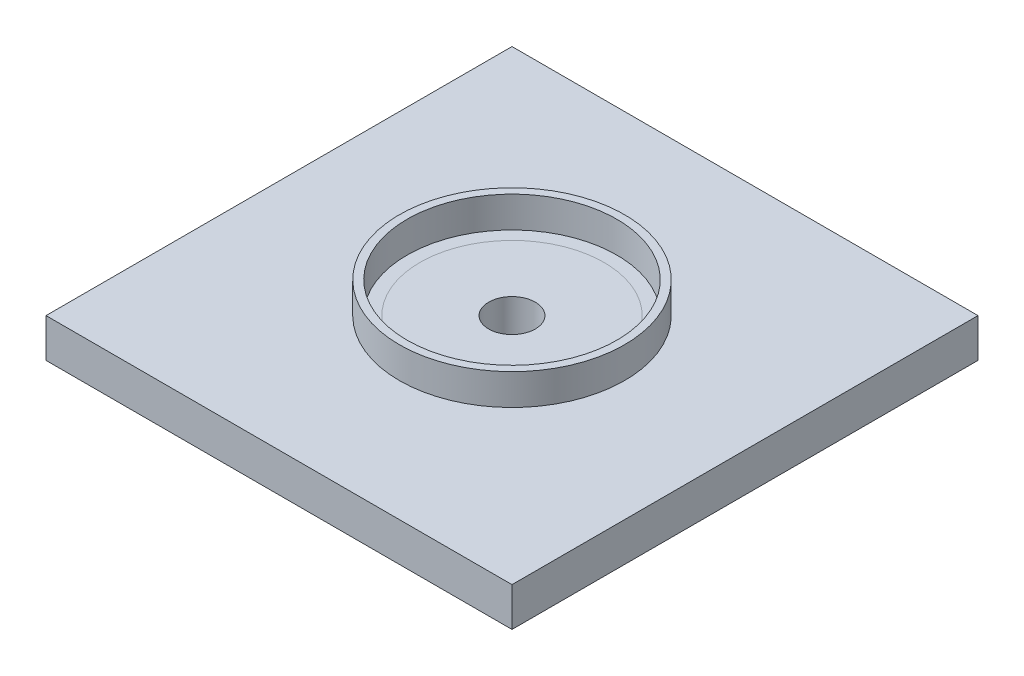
ISO-10303-21;
HEADER;
FILE_DESCRIPTION(('STEP AP214'),'2;1');
FILE_NAME('part.step','',(''),(''),'','','');
FILE_SCHEMA(('AUTOMOTIVE_DESIGN { 1 0 10303 214 1 1 1 1 }'));
ENDSEC;
DATA;
#1=APPLICATION_CONTEXT('core data for automotive mechanical design processes');
#2=APPLICATION_PROTOCOL_DEFINITION('international standard','automotive_design',2000,#1);
#3=PRODUCT_CONTEXT('',#1,'mechanical');
#4=PRODUCT('Part','Part','',(#3));
#5=PRODUCT_RELATED_PRODUCT_CATEGORY('part','',(#4));
#6=PRODUCT_DEFINITION_FORMATION('','',#4);
#7=PRODUCT_DEFINITION_CONTEXT('part definition',#1,'design');
#8=PRODUCT_DEFINITION('design','',#6,#7);
#9=PRODUCT_DEFINITION_SHAPE('','',#8);
#10=(LENGTH_UNIT() NAMED_UNIT(*) SI_UNIT(.MILLI.,.METRE.));
#11=(NAMED_UNIT(*) PLANE_ANGLE_UNIT() SI_UNIT($,.RADIAN.));
#12=(NAMED_UNIT(*) SI_UNIT($,.STERADIAN.) SOLID_ANGLE_UNIT());
#13=UNCERTAINTY_MEASURE_WITH_UNIT(LENGTH_MEASURE(1.E-05),#10,'distance_accuracy_value','');
#14=(GEOMETRIC_REPRESENTATION_CONTEXT(3) GLOBAL_UNCERTAINTY_ASSIGNED_CONTEXT((#13)) GLOBAL_UNIT_ASSIGNED_CONTEXT((#10,
#11,#12)) REPRESENTATION_CONTEXT('',''));
#15=CARTESIAN_POINT('',(0.,0.,0.));
#16=DIRECTION('',(0.,0.,1.));
#17=DIRECTION('',(1.,0.,0.));
#18=AXIS2_PLACEMENT_3D('',#15,#16,#17);
#19=CARTESIAN_POINT('',(-76.2,12.7,76.2));
#20=DIRECTION('',(0.,1.,0.));
#21=DIRECTION('',(0.,0.,1.));
#22=AXIS2_PLACEMENT_3D('',#19,#20,#21);
#23=PLANE('',#22);
#24=CARTESIAN_POINT('',(0.,12.7,0.));
#25=DIRECTION('',(0.,1.,0.));
#26=DIRECTION('',(0.,0.,1.));
#27=AXIS2_PLACEMENT_3D('',#24,#25,#26);
#28=CIRCLE('',#27,34.29);
#29=CARTESIAN_POINT('',(0.,12.7,34.29));
#30=VERTEX_POINT('',#29);
#31=EDGE_CURVE('E43',#30,#30,#28,.F.);
#32=ORIENTED_EDGE('',*,*,#31,.F.);
#33=EDGE_LOOP('',(#32));
#34=FACE_BOUND('',#33,.T.);
#35=CARTESIAN_POINT('',(0.,12.7,0.));
#36=DIRECTION('',(0.,1.,0.));
#37=DIRECTION('',(0.,0.,1.));
#38=AXIS2_PLACEMENT_3D('',#35,#36,#37);
#39=CIRCLE('',#38,30.1138414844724);
#40=CARTESIAN_POINT('',(0.,12.7,30.1138414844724));
#41=VERTEX_POINT('',#40);
#42=EDGE_CURVE('E11',#41,#41,#39,.F.);
#43=ORIENTED_EDGE('',*,*,#42,.T.);
#44=EDGE_LOOP('',(#43));
#45=FACE_BOUND('',#44,.T.);
#46=ADVANCED_FACE('F33',(#34,#45),#23,.T.);
#47=DIRECTION('',(0.,0.,1.));
#48=VECTOR('',#47,1.);
#49=CARTESIAN_POINT('',(-76.2,12.7,-76.2));
#50=LINE('',#49,#48);
#51=CARTESIAN_POINT('',(-76.2,12.7,-76.2));
#52=VERTEX_POINT('',#51);
#53=CARTESIAN_POINT('',(-76.2,12.7,76.2));
#54=VERTEX_POINT('',#53);
#55=EDGE_CURVE('E88',#52,#54,#50,.T.);
#56=ORIENTED_EDGE('',*,*,#55,.T.);
#57=DIRECTION('',(1.,0.,0.));
#58=VECTOR('',#57,1.);
#59=CARTESIAN_POINT('',(-76.2,12.7,76.2));
#60=LINE('',#59,#58);
#61=CARTESIAN_POINT('',(76.2,12.7,76.2));
#62=VERTEX_POINT('',#61);
#63=EDGE_CURVE('E82',#54,#62,#60,.T.);
#64=ORIENTED_EDGE('',*,*,#63,.T.);
#65=DIRECTION('',(0.,0.,-1.));
#66=VECTOR('',#65,1.);
#67=CARTESIAN_POINT('',(76.2,12.7,-76.2));
#68=LINE('',#67,#66);
#69=CARTESIAN_POINT('',(76.2,12.7,-76.2));
#70=VERTEX_POINT('',#69);
#71=EDGE_CURVE('E86',#62,#70,#68,.T.);
#72=ORIENTED_EDGE('',*,*,#71,.T.);
#73=DIRECTION('',(-1.,0.,0.));
#74=VECTOR('',#73,1.);
#75=CARTESIAN_POINT('',(-76.2,12.7,-76.2));
#76=LINE('',#75,#74);
#77=EDGE_CURVE('E51',#70,#52,#76,.T.);
#78=ORIENTED_EDGE('',*,*,#77,.T.);
#79=EDGE_LOOP('',(#56,#64,#72,#78));
#80=FACE_BOUND('',#79,.T.);
#81=CARTESIAN_POINT('',(0.,12.7,0.));
#82=DIRECTION('',(0.,1.,0.));
#83=DIRECTION('',(0.,0.,1.));
#84=AXIS2_PLACEMENT_3D('',#81,#82,#83);
#85=CIRCLE('',#84,36.83);
#86=CARTESIAN_POINT('',(0.,12.7,36.83));
#87=VERTEX_POINT('',#86);
#88=EDGE_CURVE('E135',#87,#87,#85,.T.);
#89=ORIENTED_EDGE('',*,*,#88,.F.);
#90=EDGE_LOOP('',(#89));
#91=FACE_BOUND('',#90,.T.);
#92=ADVANCED_FACE('F83',(#80,#91),#23,.T.);
#93=ORIENTED_EDGE('',*,*,#42,.F.);
#94=EDGE_LOOP('',(#93));
#95=FACE_BOUND('',#94,.T.);
#96=CARTESIAN_POINT('',(0.,12.7,0.));
#97=DIRECTION('',(0.,1.,0.));
#98=DIRECTION('',(0.,0.,1.));
#99=AXIS2_PLACEMENT_3D('',#96,#97,#98);
#100=CIRCLE('',#99,7.62);
#101=CARTESIAN_POINT('',(0.,12.7,7.62));
#102=VERTEX_POINT('',#101);
#103=EDGE_CURVE('E106',#102,#102,#100,.T.);
#104=ORIENTED_EDGE('',*,*,#103,.F.);
#105=EDGE_LOOP('',(#104));
#106=FACE_BOUND('',#105,.T.);
#107=ADVANCED_FACE('F120',(#95,#106),#23,.T.);
#108=CARTESIAN_POINT('',(-76.2,0.,76.2));
#109=DIRECTION('',(0.,1.,0.));
#110=DIRECTION('',(0.,0.,1.));
#111=AXIS2_PLACEMENT_3D('',#108,#109,#110);
#112=PLANE('',#111);
#113=DIRECTION('',(0.,0.,1.));
#114=VECTOR('',#113,1.);
#115=CARTESIAN_POINT('',(-76.2,0.,-76.2));
#116=LINE('',#115,#114);
#117=CARTESIAN_POINT('',(-76.2,0.,-76.2));
#118=VERTEX_POINT('',#117);
#119=CARTESIAN_POINT('',(-76.2,0.,76.2));
#120=VERTEX_POINT('',#119);
#121=EDGE_CURVE('E103',#118,#120,#116,.T.);
#122=ORIENTED_EDGE('',*,*,#121,.F.);
#123=DIRECTION('',(-1.,0.,0.));
#124=VECTOR('',#123,1.);
#125=CARTESIAN_POINT('',(-76.2,0.,-76.2));
#126=LINE('',#125,#124);
#127=CARTESIAN_POINT('',(76.2,0.,-76.2));
#128=VERTEX_POINT('',#127);
#129=EDGE_CURVE('E74',#128,#118,#126,.T.);
#130=ORIENTED_EDGE('',*,*,#129,.F.);
#131=DIRECTION('',(0.,0.,-1.));
#132=VECTOR('',#131,1.);
#133=CARTESIAN_POINT('',(76.2,0.,-76.2));
#134=LINE('',#133,#132);
#135=CARTESIAN_POINT('',(76.2,0.,76.2));
#136=VERTEX_POINT('',#135);
#137=EDGE_CURVE('E68',#136,#128,#134,.T.);
#138=ORIENTED_EDGE('',*,*,#137,.F.);
#139=DIRECTION('',(1.,0.,0.));
#140=VECTOR('',#139,1.);
#141=CARTESIAN_POINT('',(-76.2,0.,76.2));
#142=LINE('',#141,#140);
#143=EDGE_CURVE('E93',#120,#136,#142,.T.);
#144=ORIENTED_EDGE('',*,*,#143,.F.);
#145=EDGE_LOOP('',(#122,#130,#138,#144));
#146=FACE_BOUND('',#145,.T.);
#147=CARTESIAN_POINT('',(0.,0.,0.));
#148=DIRECTION('',(0.,1.,0.));
#149=DIRECTION('',(0.,0.,1.));
#150=AXIS2_PLACEMENT_3D('',#147,#148,#149);
#151=CIRCLE('',#150,7.62);
#152=CARTESIAN_POINT('',(0.,0.,7.62));
#153=VERTEX_POINT('',#152);
#154=EDGE_CURVE('E129',#153,#153,#151,.T.);
#155=ORIENTED_EDGE('',*,*,#154,.T.);
#156=EDGE_LOOP('',(#155));
#157=FACE_BOUND('',#156,.T.);
#158=ADVANCED_FACE('F125',(#146,#157),#112,.F.);
#159=CARTESIAN_POINT('',(-76.2,12.7,-76.2));
#160=DIRECTION('',(1.,0.,0.));
#161=DIRECTION('',(0.,0.,-1.));
#162=AXIS2_PLACEMENT_3D('',#159,#160,#161);
#163=PLANE('',#162);
#164=ORIENTED_EDGE('',*,*,#121,.T.);
#165=DIRECTION('',(0.,-1.,0.));
#166=VECTOR('',#165,1.);
#167=CARTESIAN_POINT('',(-76.2,12.7,76.2));
#168=LINE('',#167,#166);
#169=EDGE_CURVE('E94',#54,#120,#168,.T.);
#170=ORIENTED_EDGE('',*,*,#169,.F.);
#171=ORIENTED_EDGE('',*,*,#55,.F.);
#172=DIRECTION('',(0.,-1.,0.));
#173=VECTOR('',#172,1.);
#174=CARTESIAN_POINT('',(-76.2,12.7,-76.2));
#175=LINE('',#174,#173);
#176=EDGE_CURVE('E99',#52,#118,#175,.T.);
#177=ORIENTED_EDGE('',*,*,#176,.T.);
#178=EDGE_LOOP('',(#164,#170,#171,#177));
#179=FACE_BOUND('',#178,.T.);
#180=ADVANCED_FACE('F35',(#179),#163,.F.);
#181=CARTESIAN_POINT('',(-76.2,12.7,76.2));
#182=DIRECTION('',(0.,0.,-1.));
#183=DIRECTION('',(-1.,0.,0.));
#184=AXIS2_PLACEMENT_3D('',#181,#182,#183);
#185=PLANE('',#184);
#186=ORIENTED_EDGE('',*,*,#143,.T.);
#187=DIRECTION('',(0.,-1.,0.));
#188=VECTOR('',#187,1.);
#189=CARTESIAN_POINT('',(76.2,12.7,76.2));
#190=LINE('',#189,#188);
#191=EDGE_CURVE('E91',#62,#136,#190,.T.);
#192=ORIENTED_EDGE('',*,*,#191,.F.);
#193=ORIENTED_EDGE('',*,*,#63,.F.);
#194=ORIENTED_EDGE('',*,*,#169,.T.);
#195=EDGE_LOOP('',(#186,#192,#193,#194));
#196=FACE_BOUND('',#195,.T.);
#197=ADVANCED_FACE('F92',(#196),#185,.F.);
#198=CARTESIAN_POINT('',(76.2,12.7,-76.2));
#199=DIRECTION('',(-1.,0.,0.));
#200=DIRECTION('',(0.,0.,1.));
#201=AXIS2_PLACEMENT_3D('',#198,#199,#200);
#202=PLANE('',#201);
#203=ORIENTED_EDGE('',*,*,#137,.T.);
#204=DIRECTION('',(0.,-1.,0.));
#205=VECTOR('',#204,1.);
#206=CARTESIAN_POINT('',(76.2,12.7,-76.2));
#207=LINE('',#206,#205);
#208=EDGE_CURVE('E95',#70,#128,#207,.T.);
#209=ORIENTED_EDGE('',*,*,#208,.F.);
#210=ORIENTED_EDGE('',*,*,#71,.F.);
#211=ORIENTED_EDGE('',*,*,#191,.T.);
#212=EDGE_LOOP('',(#203,#209,#210,#211));
#213=FACE_BOUND('',#212,.T.);
#214=ADVANCED_FACE('F97',(#213),#202,.F.);
#215=CARTESIAN_POINT('',(-76.2,12.7,-76.2));
#216=DIRECTION('',(0.,0.,1.));
#217=DIRECTION('',(1.,0.,0.));
#218=AXIS2_PLACEMENT_3D('',#215,#216,#217);
#219=PLANE('',#218);
#220=ORIENTED_EDGE('',*,*,#129,.T.);
#221=ORIENTED_EDGE('',*,*,#176,.F.);
#222=ORIENTED_EDGE('',*,*,#77,.F.);
#223=ORIENTED_EDGE('',*,*,#208,.T.);
#224=EDGE_LOOP('',(#220,#221,#222,#223));
#225=FACE_BOUND('',#224,.T.);
#226=ADVANCED_FACE('F157',(#225),#219,.F.);
#227=CARTESIAN_POINT('',(0.,12.7,0.));
#228=DIRECTION('',(0.,-1.,0.));
#229=DIRECTION('',(0.,0.,-1.));
#230=AXIS2_PLACEMENT_3D('',#227,#228,#229);
#231=CYLINDRICAL_SURFACE('',#230,7.62);
#232=ORIENTED_EDGE('',*,*,#103,.T.);
#233=EDGE_LOOP('',(#232));
#234=FACE_BOUND('',#233,.T.);
#235=ORIENTED_EDGE('',*,*,#154,.F.);
#236=EDGE_LOOP('',(#235));
#237=FACE_BOUND('',#236,.T.);
#238=ADVANCED_FACE('F148',(#234,#237),#231,.F.);
#239=CARTESIAN_POINT('',(0.,22.86,0.));
#240=DIRECTION('',(0.,1.,0.));
#241=DIRECTION('',(0.,0.,1.));
#242=AXIS2_PLACEMENT_3D('',#239,#240,#241);
#243=PLANE('',#242);
#244=CARTESIAN_POINT('',(0.,22.86,0.));
#245=DIRECTION('',(0.,1.,0.));
#246=DIRECTION('',(0.,0.,1.));
#247=AXIS2_PLACEMENT_3D('',#244,#245,#246);
#248=CIRCLE('',#247,36.83);
#249=CARTESIAN_POINT('',(0.,22.86,36.83));
#250=VERTEX_POINT('',#249);
#251=EDGE_CURVE('E132',#250,#250,#248,.T.);
#252=ORIENTED_EDGE('',*,*,#251,.T.);
#253=EDGE_LOOP('',(#252));
#254=FACE_BOUND('',#253,.T.);
#255=CARTESIAN_POINT('',(0.,22.86,0.));
#256=DIRECTION('',(0.,1.,0.));
#257=DIRECTION('',(0.,0.,1.));
#258=AXIS2_PLACEMENT_3D('',#255,#256,#257);
#259=CIRCLE('',#258,34.29);
#260=CARTESIAN_POINT('',(0.,22.86,34.29));
#261=VERTEX_POINT('',#260);
#262=EDGE_CURVE('E138',#261,#261,#259,.T.);
#263=ORIENTED_EDGE('',*,*,#262,.F.);
#264=EDGE_LOOP('',(#263));
#265=FACE_BOUND('',#264,.T.);
#266=ADVANCED_FACE('F145',(#254,#265),#243,.T.);
#267=CARTESIAN_POINT('',(0.,22.86,0.));
#268=DIRECTION('',(0.,-1.,0.));
#269=DIRECTION('',(0.,0.,-1.));
#270=AXIS2_PLACEMENT_3D('',#267,#268,#269);
#271=CYLINDRICAL_SURFACE('',#270,36.83);
#272=ORIENTED_EDGE('',*,*,#251,.F.);
#273=EDGE_LOOP('',(#272));
#274=FACE_BOUND('',#273,.T.);
#275=ORIENTED_EDGE('',*,*,#88,.T.);
#276=EDGE_LOOP('',(#275));
#277=FACE_BOUND('',#276,.T.);
#278=ADVANCED_FACE('F147',(#274,#277),#271,.T.);
#279=CARTESIAN_POINT('',(0.,22.86,0.));
#280=DIRECTION('',(0.,-1.,0.));
#281=DIRECTION('',(0.,0.,-1.));
#282=AXIS2_PLACEMENT_3D('',#279,#280,#281);
#283=CYLINDRICAL_SURFACE('',#282,34.29);
#284=ORIENTED_EDGE('',*,*,#262,.T.);
#285=EDGE_LOOP('',(#284));
#286=FACE_BOUND('',#285,.T.);
#287=ORIENTED_EDGE('',*,*,#31,.T.);
#288=EDGE_LOOP('',(#287));
#289=FACE_BOUND('',#288,.T.);
#290=ADVANCED_FACE('F115',(#286,#289),#283,.F.);
#291=CLOSED_SHELL('',(#46,#92,#107,#158,#180,#197,#214,#226,#238,#266,#278,#290));
#292=MANIFOLD_SOLID_BREP('B2',#291);
#293=ADVANCED_BREP_SHAPE_REPRESENTATION('',(#18,#292),#14);
#294=SHAPE_DEFINITION_REPRESENTATION(#9,#293);
ENDSEC;
END-ISO-10303-21;
